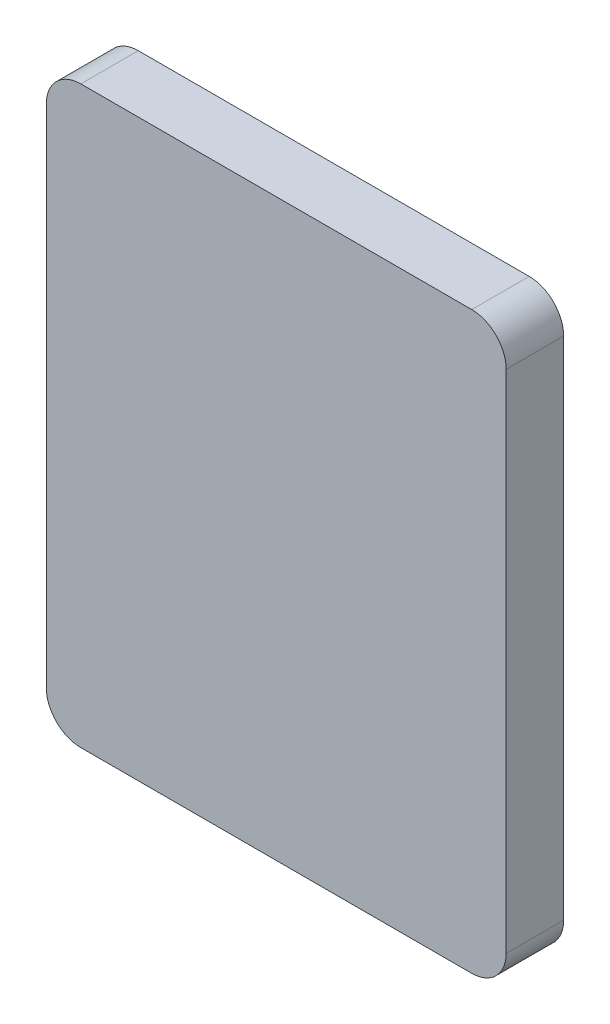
from build123d import *

# Parameters (mm, degrees)
SKETCH1_W           = 40
SKETCH1_H           = 50
BOSS_EXTRUDE1_DEPTH = 2.5
FILLET1_R           = 3


with BuildPart() as part:
    # Sketch1 → Boss-Extrude1 (new, symmetric)
    with BuildSketch(Plane.XY):
        Rectangle(SKETCH1_W, SKETCH1_H)
    extrude(amount=BOSS_EXTRUDE1_DEPTH, both=True)

    # Fillet1
    fillet1_edges = [part.edges().sort_by_distance(p)[0] for p in [
        (-20, 25, 0),
        (20, 25, 0),
        (20, -25, 0),
        (-20, -25, 0),
    ]]
    fillet(fillet1_edges, radius=FILLET1_R)


solid = part.part
